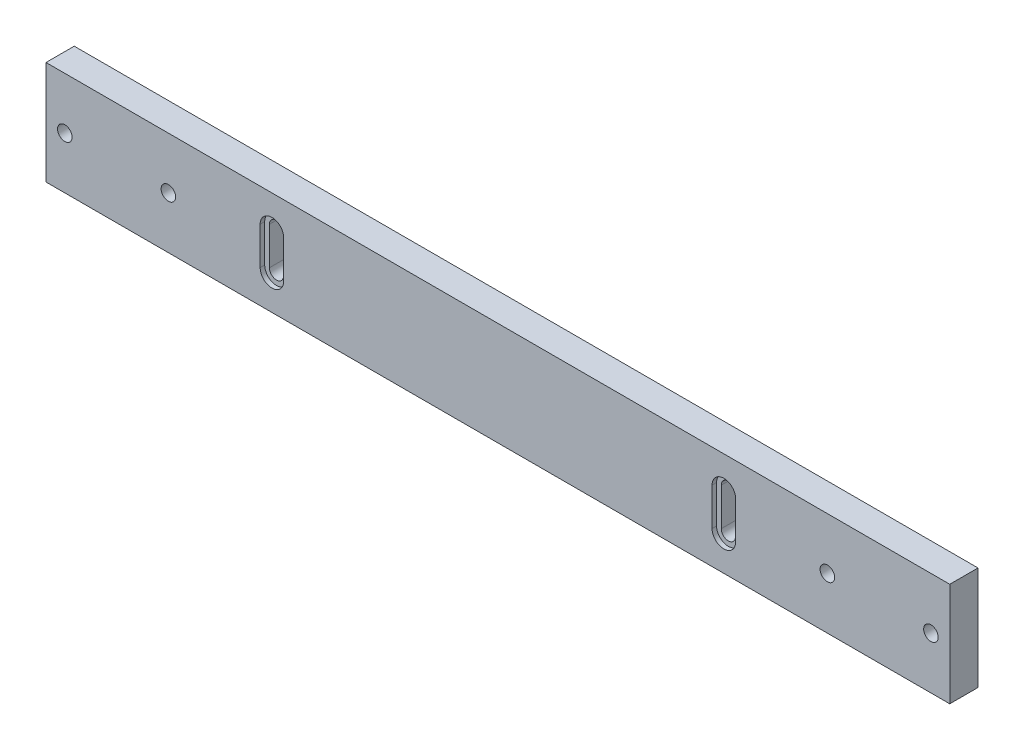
ISO-10303-21;
HEADER;
FILE_DESCRIPTION(('STEP AP214'),'2;1');
FILE_NAME('part.step','',(''),(''),'','','');
FILE_SCHEMA(('AUTOMOTIVE_DESIGN { 1 0 10303 214 1 1 1 1 }'));
ENDSEC;
DATA;
#1=APPLICATION_CONTEXT('core data for automotive mechanical design processes');
#2=APPLICATION_PROTOCOL_DEFINITION('international standard','automotive_design',2000,#1);
#3=PRODUCT_CONTEXT('',#1,'mechanical');
#4=PRODUCT('Part','Part','',(#3));
#5=PRODUCT_RELATED_PRODUCT_CATEGORY('part','',(#4));
#6=PRODUCT_DEFINITION_FORMATION('','',#4);
#7=PRODUCT_DEFINITION_CONTEXT('part definition',#1,'design');
#8=PRODUCT_DEFINITION('design','',#6,#7);
#9=PRODUCT_DEFINITION_SHAPE('','',#8);
#10=(LENGTH_UNIT() NAMED_UNIT(*) SI_UNIT(.MILLI.,.METRE.));
#11=(NAMED_UNIT(*) PLANE_ANGLE_UNIT() SI_UNIT($,.RADIAN.));
#12=(NAMED_UNIT(*) SI_UNIT($,.STERADIAN.) SOLID_ANGLE_UNIT());
#13=UNCERTAINTY_MEASURE_WITH_UNIT(LENGTH_MEASURE(1.E-05),#10,'distance_accuracy_value','');
#14=(GEOMETRIC_REPRESENTATION_CONTEXT(3) GLOBAL_UNCERTAINTY_ASSIGNED_CONTEXT((#13)) GLOBAL_UNIT_ASSIGNED_CONTEXT((#10,
#11,#12)) REPRESENTATION_CONTEXT('',''));
#15=CARTESIAN_POINT('',(0.,0.,0.));
#16=DIRECTION('',(0.,0.,1.));
#17=DIRECTION('',(1.,0.,0.));
#18=AXIS2_PLACEMENT_3D('',#15,#16,#17);
#19=CARTESIAN_POINT('',(0.,0.,19.05));
#20=DIRECTION('',(0.,0.,1.));
#21=DIRECTION('',(1.,0.,0.));
#22=AXIS2_PLACEMENT_3D('',#19,#20,#21);
#23=PLANE('',#22);
#24=CARTESIAN_POINT('',(-152.4,12.7,19.05));
#25=DIRECTION('',(0.,0.,1.));
#26=DIRECTION('',(-1.,0.,0.));
#27=AXIS2_PLACEMENT_3D('',#24,#25,#26);
#28=CIRCLE('',#27,7.9375);
#29=CARTESIAN_POINT('',(-144.4625,12.7,19.05));
#30=VERTEX_POINT('',#29);
#31=CARTESIAN_POINT('',(-160.3375,12.7,19.05));
#32=VERTEX_POINT('',#31);
#33=EDGE_CURVE('E225',#30,#32,#28,.T.);
#34=ORIENTED_EDGE('',*,*,#33,.F.);
#35=DIRECTION('',(0.,1.,0.));
#36=VECTOR('',#35,1.);
#37=CARTESIAN_POINT('',(-144.4625,12.7,19.05));
#38=LINE('',#37,#36);
#39=CARTESIAN_POINT('',(-144.4625,-12.7,19.05));
#40=VERTEX_POINT('',#39);
#41=EDGE_CURVE('E238',#40,#30,#38,.T.);
#42=ORIENTED_EDGE('',*,*,#41,.F.);
#43=CARTESIAN_POINT('',(-152.4,-12.7,19.05));
#44=DIRECTION('',(0.,0.,1.));
#45=DIRECTION('',(-1.,0.,0.));
#46=AXIS2_PLACEMENT_3D('',#43,#44,#45);
#47=CIRCLE('',#46,7.9375);
#48=CARTESIAN_POINT('',(-160.3375,-12.7,19.05));
#49=VERTEX_POINT('',#48);
#50=EDGE_CURVE('E252',#49,#40,#47,.T.);
#51=ORIENTED_EDGE('',*,*,#50,.F.);
#52=DIRECTION('',(0.,-1.,0.));
#53=VECTOR('',#52,1.);
#54=CARTESIAN_POINT('',(-160.3375,12.7,19.05));
#55=LINE('',#54,#53);
#56=EDGE_CURVE('E249',#32,#49,#55,.T.);
#57=ORIENTED_EDGE('',*,*,#56,.F.);
#58=EDGE_LOOP('',(#34,#42,#51,#57));
#59=FACE_BOUND('',#58,.T.);
#60=CARTESIAN_POINT('',(292.1,0.,19.05));
#61=DIRECTION('',(0.,0.,-1.));
#62=DIRECTION('',(-1.,0.,0.));
#63=AXIS2_PLACEMENT_3D('',#60,#61,#62);
#64=CIRCLE('',#63,4.90219999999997);
#65=CARTESIAN_POINT('',(287.1978,0.,19.05));
#66=VERTEX_POINT('',#65);
#67=EDGE_CURVE('E307',#66,#66,#64,.T.);
#68=ORIENTED_EDGE('',*,*,#67,.T.);
#69=EDGE_LOOP('',(#68));
#70=FACE_BOUND('',#69,.T.);
#71=CARTESIAN_POINT('',(222.25,0.,19.05));
#72=DIRECTION('',(0.,0.,-1.));
#73=DIRECTION('',(-1.,0.,0.));
#74=AXIS2_PLACEMENT_3D('',#71,#72,#73);
#75=CIRCLE('',#74,4.9022);
#76=CARTESIAN_POINT('',(217.3478,0.,19.05));
#77=VERTEX_POINT('',#76);
#78=EDGE_CURVE('E319',#77,#77,#75,.T.);
#79=ORIENTED_EDGE('',*,*,#78,.T.);
#80=EDGE_LOOP('',(#79));
#81=FACE_BOUND('',#80,.T.);
#82=CARTESIAN_POINT('',(-222.25,0.,19.05));
#83=DIRECTION('',(0.,0.,-1.));
#84=DIRECTION('',(-1.,0.,0.));
#85=AXIS2_PLACEMENT_3D('',#82,#83,#84);
#86=CIRCLE('',#85,4.9022);
#87=CARTESIAN_POINT('',(-227.1522,0.,19.05));
#88=VERTEX_POINT('',#87);
#89=EDGE_CURVE('E331',#88,#88,#86,.T.);
#90=ORIENTED_EDGE('',*,*,#89,.T.);
#91=EDGE_LOOP('',(#90));
#92=FACE_BOUND('',#91,.T.);
#93=CARTESIAN_POINT('',(-292.1,0.,19.05));
#94=DIRECTION('',(0.,0.,-1.));
#95=DIRECTION('',(-1.,0.,0.));
#96=AXIS2_PLACEMENT_3D('',#93,#94,#95);
#97=CIRCLE('',#96,4.90219999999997);
#98=CARTESIAN_POINT('',(-297.0022,0.,19.05));
#99=VERTEX_POINT('',#98);
#100=EDGE_CURVE('E343',#99,#99,#97,.T.);
#101=ORIENTED_EDGE('',*,*,#100,.T.);
#102=EDGE_LOOP('',(#101));
#103=FACE_BOUND('',#102,.T.);
#104=DIRECTION('',(0.,-1.,0.));
#105=VECTOR('',#104,1.);
#106=CARTESIAN_POINT('',(-304.8,34.925,19.05));
#107=LINE('',#106,#105);
#108=CARTESIAN_POINT('',(-304.8,34.925,19.05));
#109=VERTEX_POINT('',#108);
#110=CARTESIAN_POINT('',(-304.8,-34.9250000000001,19.05));
#111=VERTEX_POINT('',#110);
#112=EDGE_CURVE('E347',#109,#111,#107,.T.);
#113=ORIENTED_EDGE('',*,*,#112,.T.);
#114=DIRECTION('',(1.,0.,0.));
#115=VECTOR('',#114,1.);
#116=CARTESIAN_POINT('',(-304.8,-34.9250000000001,19.05));
#117=LINE('',#116,#115);
#118=CARTESIAN_POINT('',(304.8,-34.925,19.05));
#119=VERTEX_POINT('',#118);
#120=EDGE_CURVE('E350',#111,#119,#117,.T.);
#121=ORIENTED_EDGE('',*,*,#120,.T.);
#122=DIRECTION('',(0.,1.,0.));
#123=VECTOR('',#122,1.);
#124=CARTESIAN_POINT('',(304.8,34.9250000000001,19.05));
#125=LINE('',#124,#123);
#126=CARTESIAN_POINT('',(304.8,34.9250000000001,19.05));
#127=VERTEX_POINT('',#126);
#128=EDGE_CURVE('E353',#119,#127,#125,.T.);
#129=ORIENTED_EDGE('',*,*,#128,.T.);
#130=DIRECTION('',(-1.,0.,0.));
#131=VECTOR('',#130,1.);
#132=CARTESIAN_POINT('',(-304.8,34.925,19.05));
#133=LINE('',#132,#131);
#134=EDGE_CURVE('E355',#127,#109,#133,.T.);
#135=ORIENTED_EDGE('',*,*,#134,.T.);
#136=EDGE_LOOP('',(#113,#121,#129,#135));
#137=FACE_BOUND('',#136,.T.);
#138=DIRECTION('',(0.,1.,0.));
#139=VECTOR('',#138,1.);
#140=CARTESIAN_POINT('',(144.4625,12.7,19.05));
#141=LINE('',#140,#139);
#142=CARTESIAN_POINT('',(144.4625,-12.7,19.05));
#143=VERTEX_POINT('',#142);
#144=CARTESIAN_POINT('',(144.4625,12.7,19.05));
#145=VERTEX_POINT('',#144);
#146=EDGE_CURVE('E198',#143,#145,#141,.T.);
#147=ORIENTED_EDGE('',*,*,#146,.T.);
#148=CARTESIAN_POINT('',(152.4,12.7,19.05));
#149=DIRECTION('',(0.,0.,-1.));
#150=DIRECTION('',(1.,0.,0.));
#151=AXIS2_PLACEMENT_3D('',#148,#149,#150);
#152=CIRCLE('',#151,7.9375);
#153=CARTESIAN_POINT('',(160.3375,12.7,19.05));
#154=VERTEX_POINT('',#153);
#155=EDGE_CURVE('E48',#145,#154,#152,.T.);
#156=ORIENTED_EDGE('',*,*,#155,.T.);
#157=DIRECTION('',(0.,-1.,0.));
#158=VECTOR('',#157,1.);
#159=CARTESIAN_POINT('',(160.3375,12.7,19.05));
#160=LINE('',#159,#158);
#161=CARTESIAN_POINT('',(160.3375,-12.7,19.05));
#162=VERTEX_POINT('',#161);
#163=EDGE_CURVE('E189',#154,#162,#160,.T.);
#164=ORIENTED_EDGE('',*,*,#163,.T.);
#165=CARTESIAN_POINT('',(152.4,-12.7,19.05));
#166=DIRECTION('',(0.,0.,-1.));
#167=DIRECTION('',(1.,0.,0.));
#168=AXIS2_PLACEMENT_3D('',#165,#166,#167);
#169=CIRCLE('',#168,7.9375);
#170=EDGE_CURVE('E192',#162,#143,#169,.T.);
#171=ORIENTED_EDGE('',*,*,#170,.T.);
#172=EDGE_LOOP('',(#147,#156,#164,#171));
#173=FACE_BOUND('',#172,.T.);
#174=ADVANCED_FACE('F33',(#59,#70,#81,#92,#103,#137,#173),#23,.T.);
#175=CARTESIAN_POINT('',(0.,0.,0.));
#176=DIRECTION('',(0.,0.,1.));
#177=DIRECTION('',(1.,0.,0.));
#178=AXIS2_PLACEMENT_3D('',#175,#176,#177);
#179=PLANE('',#178);
#180=DIRECTION('',(0.,-1.,0.));
#181=VECTOR('',#180,1.);
#182=CARTESIAN_POINT('',(-304.8,34.925,0.));
#183=LINE('',#182,#181);
#184=CARTESIAN_POINT('',(-304.8,34.925,0.));
#185=VERTEX_POINT('',#184);
#186=CARTESIAN_POINT('',(-304.8,-34.9250000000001,0.));
#187=VERTEX_POINT('',#186);
#188=EDGE_CURVE('E346',#185,#187,#183,.T.);
#189=ORIENTED_EDGE('',*,*,#188,.F.);
#190=DIRECTION('',(-1.,0.,0.));
#191=VECTOR('',#190,1.);
#192=CARTESIAN_POINT('',(-304.8,34.925,0.));
#193=LINE('',#192,#191);
#194=CARTESIAN_POINT('',(304.8,34.9250000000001,0.));
#195=VERTEX_POINT('',#194);
#196=EDGE_CURVE('E351',#195,#185,#193,.T.);
#197=ORIENTED_EDGE('',*,*,#196,.F.);
#198=DIRECTION('',(0.,1.,0.));
#199=VECTOR('',#198,1.);
#200=CARTESIAN_POINT('',(304.8,34.9250000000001,0.));
#201=LINE('',#200,#199);
#202=CARTESIAN_POINT('',(304.8,-34.925,0.));
#203=VERTEX_POINT('',#202);
#204=EDGE_CURVE('E362',#203,#195,#201,.T.);
#205=ORIENTED_EDGE('',*,*,#204,.F.);
#206=DIRECTION('',(1.,0.,0.));
#207=VECTOR('',#206,1.);
#208=CARTESIAN_POINT('',(-304.8,-34.9250000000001,0.));
#209=LINE('',#208,#207);
#210=EDGE_CURVE('E360',#187,#203,#209,.T.);
#211=ORIENTED_EDGE('',*,*,#210,.F.);
#212=EDGE_LOOP('',(#189,#197,#205,#211));
#213=FACE_BOUND('',#212,.T.);
#214=CARTESIAN_POINT('',(-292.1,0.,0.));
#215=DIRECTION('',(0.,0.,-1.));
#216=DIRECTION('',(-1.,0.,0.));
#217=AXIS2_PLACEMENT_3D('',#214,#215,#216);
#218=CIRCLE('',#217,7.93749999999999);
#219=CARTESIAN_POINT('',(-300.0375,0.,0.));
#220=VERTEX_POINT('',#219);
#221=EDGE_CURVE('E334',#220,#220,#218,.T.);
#222=ORIENTED_EDGE('',*,*,#221,.F.);
#223=EDGE_LOOP('',(#222));
#224=FACE_BOUND('',#223,.T.);
#225=CARTESIAN_POINT('',(-222.25,0.,0.));
#226=DIRECTION('',(0.,0.,-1.));
#227=DIRECTION('',(-1.,0.,0.));
#228=AXIS2_PLACEMENT_3D('',#225,#226,#227);
#229=CIRCLE('',#228,7.93750000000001);
#230=CARTESIAN_POINT('',(-230.1875,0.,0.));
#231=VERTEX_POINT('',#230);
#232=EDGE_CURVE('E322',#231,#231,#229,.T.);
#233=ORIENTED_EDGE('',*,*,#232,.F.);
#234=EDGE_LOOP('',(#233));
#235=FACE_BOUND('',#234,.T.);
#236=CARTESIAN_POINT('',(222.25,0.,0.));
#237=DIRECTION('',(0.,0.,-1.));
#238=DIRECTION('',(-1.,0.,0.));
#239=AXIS2_PLACEMENT_3D('',#236,#237,#238);
#240=CIRCLE('',#239,7.93750000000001);
#241=CARTESIAN_POINT('',(214.3125,0.,0.));
#242=VERTEX_POINT('',#241);
#243=EDGE_CURVE('E310',#242,#242,#240,.T.);
#244=ORIENTED_EDGE('',*,*,#243,.F.);
#245=EDGE_LOOP('',(#244));
#246=FACE_BOUND('',#245,.T.);
#247=CARTESIAN_POINT('',(292.1,0.,0.));
#248=DIRECTION('',(0.,0.,-1.));
#249=DIRECTION('',(-1.,0.,0.));
#250=AXIS2_PLACEMENT_3D('',#247,#248,#249);
#251=CIRCLE('',#250,7.93749999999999);
#252=CARTESIAN_POINT('',(284.1625,0.,0.));
#253=VERTEX_POINT('',#252);
#254=EDGE_CURVE('E290',#253,#253,#251,.T.);
#255=ORIENTED_EDGE('',*,*,#254,.F.);
#256=EDGE_LOOP('',(#255));
#257=FACE_BOUND('',#256,.T.);
#258=DIRECTION('',(0.,1.,0.));
#259=VECTOR('',#258,1.);
#260=CARTESIAN_POINT('',(-147.6375,12.7,0.));
#261=LINE('',#260,#259);
#262=CARTESIAN_POINT('',(-147.6375,-12.7,0.));
#263=VERTEX_POINT('',#262);
#264=CARTESIAN_POINT('',(-147.6375,12.7,0.));
#265=VERTEX_POINT('',#264);
#266=EDGE_CURVE('E283',#263,#265,#261,.T.);
#267=ORIENTED_EDGE('',*,*,#266,.T.);
#268=CARTESIAN_POINT('',(-152.4,12.7,0.));
#269=DIRECTION('',(0.,0.,1.));
#270=DIRECTION('',(-1.,0.,0.));
#271=AXIS2_PLACEMENT_3D('',#268,#269,#270);
#272=CIRCLE('',#271,4.7625);
#273=CARTESIAN_POINT('',(-157.1625,12.7,0.));
#274=VERTEX_POINT('',#273);
#275=EDGE_CURVE('E274',#265,#274,#272,.T.);
#276=ORIENTED_EDGE('',*,*,#275,.T.);
#277=DIRECTION('',(0.,-1.,0.));
#278=VECTOR('',#277,1.);
#279=CARTESIAN_POINT('',(-157.1625,12.7,0.));
#280=LINE('',#279,#278);
#281=CARTESIAN_POINT('',(-157.1625,-12.7,0.));
#282=VERTEX_POINT('',#281);
#283=EDGE_CURVE('E277',#274,#282,#280,.T.);
#284=ORIENTED_EDGE('',*,*,#283,.T.);
#285=CARTESIAN_POINT('',(-152.4,-12.7,0.));
#286=DIRECTION('',(0.,0.,1.));
#287=DIRECTION('',(-1.,0.,0.));
#288=AXIS2_PLACEMENT_3D('',#285,#286,#287);
#289=CIRCLE('',#288,4.7625);
#290=EDGE_CURVE('E280',#282,#263,#289,.T.);
#291=ORIENTED_EDGE('',*,*,#290,.T.);
#292=EDGE_LOOP('',(#267,#276,#284,#291));
#293=FACE_BOUND('',#292,.T.);
#294=CARTESIAN_POINT('',(152.4,12.7,0.));
#295=DIRECTION('',(0.,0.,-1.));
#296=DIRECTION('',(1.,0.,0.));
#297=AXIS2_PLACEMENT_3D('',#294,#295,#296);
#298=CIRCLE('',#297,4.7625);
#299=CARTESIAN_POINT('',(147.6375,12.7,0.));
#300=VERTEX_POINT('',#299);
#301=CARTESIAN_POINT('',(157.1625,12.7,0.));
#302=VERTEX_POINT('',#301);
#303=EDGE_CURVE('E212',#300,#302,#298,.T.);
#304=ORIENTED_EDGE('',*,*,#303,.F.);
#305=DIRECTION('',(0.,1.,0.));
#306=VECTOR('',#305,1.);
#307=CARTESIAN_POINT('',(147.6375,12.7,0.));
#308=LINE('',#307,#306);
#309=CARTESIAN_POINT('',(147.6375,-12.7,0.));
#310=VERTEX_POINT('',#309);
#311=EDGE_CURVE('E214',#310,#300,#308,.T.);
#312=ORIENTED_EDGE('',*,*,#311,.F.);
#313=CARTESIAN_POINT('',(152.4,-12.7,0.));
#314=DIRECTION('',(0.,0.,-1.));
#315=DIRECTION('',(1.,0.,0.));
#316=AXIS2_PLACEMENT_3D('',#313,#314,#315);
#317=CIRCLE('',#316,4.7625);
#318=CARTESIAN_POINT('',(157.1625,-12.7,0.));
#319=VERTEX_POINT('',#318);
#320=EDGE_CURVE('E216',#319,#310,#317,.T.);
#321=ORIENTED_EDGE('',*,*,#320,.F.);
#322=DIRECTION('',(0.,-1.,0.));
#323=VECTOR('',#322,1.);
#324=CARTESIAN_POINT('',(157.1625,12.7,0.));
#325=LINE('',#324,#323);
#326=EDGE_CURVE('E219',#302,#319,#325,.T.);
#327=ORIENTED_EDGE('',*,*,#326,.F.);
#328=EDGE_LOOP('',(#304,#312,#321,#327));
#329=FACE_BOUND('',#328,.T.);
#330=ADVANCED_FACE('F385',(#213,#224,#235,#246,#257,#293,#329),#179,.F.);
#331=CARTESIAN_POINT('',(-304.8,34.925,19.05));
#332=DIRECTION('',(1.,0.,0.));
#333=DIRECTION('',(0.,0.,-1.));
#334=AXIS2_PLACEMENT_3D('',#331,#332,#333);
#335=PLANE('',#334);
#336=ORIENTED_EDGE('',*,*,#188,.T.);
#337=DIRECTION('',(0.,0.,-1.));
#338=VECTOR('',#337,1.);
#339=CARTESIAN_POINT('',(-304.8,-34.9250000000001,19.05));
#340=LINE('',#339,#338);
#341=EDGE_CURVE('E373',#111,#187,#340,.T.);
#342=ORIENTED_EDGE('',*,*,#341,.F.);
#343=ORIENTED_EDGE('',*,*,#112,.F.);
#344=DIRECTION('',(0.,0.,-1.));
#345=VECTOR('',#344,1.);
#346=CARTESIAN_POINT('',(-304.8,34.925,19.05));
#347=LINE('',#346,#345);
#348=EDGE_CURVE('E357',#109,#185,#347,.T.);
#349=ORIENTED_EDGE('',*,*,#348,.T.);
#350=EDGE_LOOP('',(#336,#342,#343,#349));
#351=FACE_BOUND('',#350,.T.);
#352=ADVANCED_FACE('F35',(#351),#335,.F.);
#353=CARTESIAN_POINT('',(-304.8,-34.9250000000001,19.05));
#354=DIRECTION('',(0.,1.,0.));
#355=DIRECTION('',(-1.,0.,0.));
#356=AXIS2_PLACEMENT_3D('',#353,#354,#355);
#357=PLANE('',#356);
#358=ORIENTED_EDGE('',*,*,#210,.T.);
#359=DIRECTION('',(0.,0.,-1.));
#360=VECTOR('',#359,1.);
#361=CARTESIAN_POINT('',(304.8,-34.925,19.05));
#362=LINE('',#361,#360);
#363=EDGE_CURVE('E370',#119,#203,#362,.T.);
#364=ORIENTED_EDGE('',*,*,#363,.F.);
#365=ORIENTED_EDGE('',*,*,#120,.F.);
#366=ORIENTED_EDGE('',*,*,#341,.T.);
#367=EDGE_LOOP('',(#358,#364,#365,#366));
#368=FACE_BOUND('',#367,.T.);
#369=ADVANCED_FACE('F423',(#368),#357,.F.);
#370=CARTESIAN_POINT('',(304.8,34.9250000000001,19.05));
#371=DIRECTION('',(-1.,0.,0.));
#372=DIRECTION('',(0.,0.,1.));
#373=AXIS2_PLACEMENT_3D('',#370,#371,#372);
#374=PLANE('',#373);
#375=ORIENTED_EDGE('',*,*,#204,.T.);
#376=DIRECTION('',(0.,0.,-1.));
#377=VECTOR('',#376,1.);
#378=CARTESIAN_POINT('',(304.8,34.9250000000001,19.05));
#379=LINE('',#378,#377);
#380=EDGE_CURVE('E367',#127,#195,#379,.T.);
#381=ORIENTED_EDGE('',*,*,#380,.F.);
#382=ORIENTED_EDGE('',*,*,#128,.F.);
#383=ORIENTED_EDGE('',*,*,#363,.T.);
#384=EDGE_LOOP('',(#375,#381,#382,#383));
#385=FACE_BOUND('',#384,.T.);
#386=ADVANCED_FACE('F420',(#385),#374,.F.);
#387=CARTESIAN_POINT('',(-304.8,34.925,19.05));
#388=DIRECTION('',(0.,-1.,0.));
#389=DIRECTION('',(1.,0.,0.));
#390=AXIS2_PLACEMENT_3D('',#387,#388,#389);
#391=PLANE('',#390);
#392=ORIENTED_EDGE('',*,*,#196,.T.);
#393=ORIENTED_EDGE('',*,*,#348,.F.);
#394=ORIENTED_EDGE('',*,*,#134,.F.);
#395=ORIENTED_EDGE('',*,*,#380,.T.);
#396=EDGE_LOOP('',(#392,#393,#394,#395));
#397=FACE_BOUND('',#396,.T.);
#398=ADVANCED_FACE('F417',(#397),#391,.F.);
#399=CARTESIAN_POINT('',(-292.1,0.,0.));
#400=DIRECTION('',(0.,0.,-1.));
#401=DIRECTION('',(-1.,0.,0.));
#402=AXIS2_PLACEMENT_3D('',#399,#400,#401);
#403=CYLINDRICAL_SURFACE('',#402,4.9022);
#404=ORIENTED_EDGE('',*,*,#100,.F.);
#405=EDGE_LOOP('',(#404));
#406=FACE_BOUND('',#405,.T.);
#407=CARTESIAN_POINT('',(-292.1,0.,9.525));
#408=DIRECTION('',(0.,0.,-1.));
#409=DIRECTION('',(-1.,0.,0.));
#410=AXIS2_PLACEMENT_3D('',#407,#408,#409);
#411=CIRCLE('',#410,4.90220000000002);
#412=CARTESIAN_POINT('',(-297.0022,0.,9.525));
#413=VERTEX_POINT('',#412);
#414=EDGE_CURVE('E340',#413,#413,#411,.T.);
#415=ORIENTED_EDGE('',*,*,#414,.T.);
#416=EDGE_LOOP('',(#415));
#417=FACE_BOUND('',#416,.T.);
#418=ADVANCED_FACE('F414',(#406,#417),#403,.F.);
#419=CARTESIAN_POINT('',(-287.1978,0.,9.525));
#420=DIRECTION('',(0.,0.,1.));
#421=DIRECTION('',(1.,0.,0.));
#422=AXIS2_PLACEMENT_3D('',#419,#420,#421);
#423=PLANE('',#422);
#424=ORIENTED_EDGE('',*,*,#414,.F.);
#425=EDGE_LOOP('',(#424));
#426=FACE_BOUND('',#425,.T.);
#427=CARTESIAN_POINT('',(-292.1,0.,9.525));
#428=DIRECTION('',(0.,0.,-1.));
#429=DIRECTION('',(-1.,0.,0.));
#430=AXIS2_PLACEMENT_3D('',#427,#428,#429);
#431=CIRCLE('',#430,7.93749999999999);
#432=CARTESIAN_POINT('',(-300.0375,0.,9.525));
#433=VERTEX_POINT('',#432);
#434=EDGE_CURVE('E337',#433,#433,#431,.T.);
#435=ORIENTED_EDGE('',*,*,#434,.T.);
#436=EDGE_LOOP('',(#435));
#437=FACE_BOUND('',#436,.T.);
#438=ADVANCED_FACE('F711',(#426,#437),#423,.F.);
#439=CARTESIAN_POINT('',(-292.1,0.,0.));
#440=DIRECTION('',(0.,0.,-1.));
#441=DIRECTION('',(-1.,0.,0.));
#442=AXIS2_PLACEMENT_3D('',#439,#440,#441);
#443=CYLINDRICAL_SURFACE('',#442,7.93749999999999);
#444=ORIENTED_EDGE('',*,*,#434,.F.);
#445=EDGE_LOOP('',(#444));
#446=FACE_BOUND('',#445,.T.);
#447=ORIENTED_EDGE('',*,*,#221,.T.);
#448=EDGE_LOOP('',(#447));
#449=FACE_BOUND('',#448,.T.);
#450=ADVANCED_FACE('F702',(#446,#449),#443,.F.);
#451=CARTESIAN_POINT('',(-222.25,0.,0.));
#452=DIRECTION('',(0.,0.,-1.));
#453=DIRECTION('',(-1.,0.,0.));
#454=AXIS2_PLACEMENT_3D('',#451,#452,#453);
#455=CYLINDRICAL_SURFACE('',#454,4.9022);
#456=ORIENTED_EDGE('',*,*,#89,.F.);
#457=EDGE_LOOP('',(#456));
#458=FACE_BOUND('',#457,.T.);
#459=CARTESIAN_POINT('',(-222.25,0.,9.525));
#460=DIRECTION('',(0.,0.,-1.));
#461=DIRECTION('',(-1.,0.,0.));
#462=AXIS2_PLACEMENT_3D('',#459,#460,#461);
#463=CIRCLE('',#462,4.9022);
#464=CARTESIAN_POINT('',(-227.1522,0.,9.525));
#465=VERTEX_POINT('',#464);
#466=EDGE_CURVE('E328',#465,#465,#463,.T.);
#467=ORIENTED_EDGE('',*,*,#466,.T.);
#468=EDGE_LOOP('',(#467));
#469=FACE_BOUND('',#468,.T.);
#470=ADVANCED_FACE('F693',(#458,#469),#455,.F.);
#471=CARTESIAN_POINT('',(-217.3478,0.,9.525));
#472=DIRECTION('',(0.,0.,1.));
#473=DIRECTION('',(1.,0.,0.));
#474=AXIS2_PLACEMENT_3D('',#471,#472,#473);
#475=PLANE('',#474);
#476=ORIENTED_EDGE('',*,*,#466,.F.);
#477=EDGE_LOOP('',(#476));
#478=FACE_BOUND('',#477,.T.);
#479=CARTESIAN_POINT('',(-222.25,0.,9.525));
#480=DIRECTION('',(0.,0.,-1.));
#481=DIRECTION('',(-1.,0.,0.));
#482=AXIS2_PLACEMENT_3D('',#479,#480,#481);
#483=CIRCLE('',#482,7.93750000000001);
#484=CARTESIAN_POINT('',(-230.1875,0.,9.525));
#485=VERTEX_POINT('',#484);
#486=EDGE_CURVE('E325',#485,#485,#483,.T.);
#487=ORIENTED_EDGE('',*,*,#486,.T.);
#488=EDGE_LOOP('',(#487));
#489=FACE_BOUND('',#488,.T.);
#490=ADVANCED_FACE('F684',(#478,#489),#475,.F.);
#491=CARTESIAN_POINT('',(-222.25,0.,0.));
#492=DIRECTION('',(0.,0.,-1.));
#493=DIRECTION('',(-1.,0.,0.));
#494=AXIS2_PLACEMENT_3D('',#491,#492,#493);
#495=CYLINDRICAL_SURFACE('',#494,7.93750000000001);
#496=ORIENTED_EDGE('',*,*,#486,.F.);
#497=EDGE_LOOP('',(#496));
#498=FACE_BOUND('',#497,.T.);
#499=ORIENTED_EDGE('',*,*,#232,.T.);
#500=EDGE_LOOP('',(#499));
#501=FACE_BOUND('',#500,.T.);
#502=ADVANCED_FACE('F675',(#498,#501),#495,.F.);
#503=CARTESIAN_POINT('',(222.25,0.,0.));
#504=DIRECTION('',(0.,0.,-1.));
#505=DIRECTION('',(-1.,0.,0.));
#506=AXIS2_PLACEMENT_3D('',#503,#504,#505);
#507=CYLINDRICAL_SURFACE('',#506,4.9022);
#508=ORIENTED_EDGE('',*,*,#78,.F.);
#509=EDGE_LOOP('',(#508));
#510=FACE_BOUND('',#509,.T.);
#511=CARTESIAN_POINT('',(222.25,0.,9.525));
#512=DIRECTION('',(0.,0.,-1.));
#513=DIRECTION('',(-1.,0.,0.));
#514=AXIS2_PLACEMENT_3D('',#511,#512,#513);
#515=CIRCLE('',#514,4.9022);
#516=CARTESIAN_POINT('',(217.3478,0.,9.525));
#517=VERTEX_POINT('',#516);
#518=EDGE_CURVE('E316',#517,#517,#515,.T.);
#519=ORIENTED_EDGE('',*,*,#518,.T.);
#520=EDGE_LOOP('',(#519));
#521=FACE_BOUND('',#520,.T.);
#522=ADVANCED_FACE('F666',(#510,#521),#507,.F.);
#523=CARTESIAN_POINT('',(227.1522,0.,9.525));
#524=DIRECTION('',(0.,0.,1.));
#525=DIRECTION('',(1.,0.,0.));
#526=AXIS2_PLACEMENT_3D('',#523,#524,#525);
#527=PLANE('',#526);
#528=ORIENTED_EDGE('',*,*,#518,.F.);
#529=EDGE_LOOP('',(#528));
#530=FACE_BOUND('',#529,.T.);
#531=CARTESIAN_POINT('',(222.25,0.,9.525));
#532=DIRECTION('',(0.,0.,-1.));
#533=DIRECTION('',(-1.,0.,0.));
#534=AXIS2_PLACEMENT_3D('',#531,#532,#533);
#535=CIRCLE('',#534,7.93750000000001);
#536=CARTESIAN_POINT('',(214.3125,0.,9.525));
#537=VERTEX_POINT('',#536);
#538=EDGE_CURVE('E313',#537,#537,#535,.T.);
#539=ORIENTED_EDGE('',*,*,#538,.T.);
#540=EDGE_LOOP('',(#539));
#541=FACE_BOUND('',#540,.T.);
#542=ADVANCED_FACE('F657',(#530,#541),#527,.F.);
#543=CARTESIAN_POINT('',(222.25,0.,0.));
#544=DIRECTION('',(0.,0.,-1.));
#545=DIRECTION('',(-1.,0.,0.));
#546=AXIS2_PLACEMENT_3D('',#543,#544,#545);
#547=CYLINDRICAL_SURFACE('',#546,7.93750000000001);
#548=ORIENTED_EDGE('',*,*,#538,.F.);
#549=EDGE_LOOP('',(#548));
#550=FACE_BOUND('',#549,.T.);
#551=ORIENTED_EDGE('',*,*,#243,.T.);
#552=EDGE_LOOP('',(#551));
#553=FACE_BOUND('',#552,.T.);
#554=ADVANCED_FACE('F648',(#550,#553),#547,.F.);
#555=CARTESIAN_POINT('',(292.1,0.,0.));
#556=DIRECTION('',(0.,0.,-1.));
#557=DIRECTION('',(-1.,0.,0.));
#558=AXIS2_PLACEMENT_3D('',#555,#556,#557);
#559=CYLINDRICAL_SURFACE('',#558,4.9022);
#560=ORIENTED_EDGE('',*,*,#67,.F.);
#561=EDGE_LOOP('',(#560));
#562=FACE_BOUND('',#561,.T.);
#563=CARTESIAN_POINT('',(292.1,0.,9.525));
#564=DIRECTION('',(0.,0.,-1.));
#565=DIRECTION('',(-1.,0.,0.));
#566=AXIS2_PLACEMENT_3D('',#563,#564,#565);
#567=CIRCLE('',#566,4.90220000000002);
#568=CARTESIAN_POINT('',(287.1978,0.,9.525));
#569=VERTEX_POINT('',#568);
#570=EDGE_CURVE('E304',#569,#569,#567,.T.);
#571=ORIENTED_EDGE('',*,*,#570,.T.);
#572=EDGE_LOOP('',(#571));
#573=FACE_BOUND('',#572,.T.);
#574=ADVANCED_FACE('F639',(#562,#573),#559,.F.);
#575=CARTESIAN_POINT('',(297.0022,0.,9.525));
#576=DIRECTION('',(0.,0.,1.));
#577=DIRECTION('',(1.,0.,0.));
#578=AXIS2_PLACEMENT_3D('',#575,#576,#577);
#579=PLANE('',#578);
#580=ORIENTED_EDGE('',*,*,#570,.F.);
#581=EDGE_LOOP('',(#580));
#582=FACE_BOUND('',#581,.T.);
#583=CARTESIAN_POINT('',(292.1,0.,9.525));
#584=DIRECTION('',(0.,0.,-1.));
#585=DIRECTION('',(-1.,0.,0.));
#586=AXIS2_PLACEMENT_3D('',#583,#584,#585);
#587=CIRCLE('',#586,7.93749999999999);
#588=CARTESIAN_POINT('',(284.1625,0.,9.525));
#589=VERTEX_POINT('',#588);
#590=EDGE_CURVE('E301',#589,#589,#587,.T.);
#591=ORIENTED_EDGE('',*,*,#590,.T.);
#592=EDGE_LOOP('',(#591));
#593=FACE_BOUND('',#592,.T.);
#594=ADVANCED_FACE('F630',(#582,#593),#579,.F.);
#595=CARTESIAN_POINT('',(292.1,0.,0.));
#596=DIRECTION('',(0.,0.,-1.));
#597=DIRECTION('',(-1.,0.,0.));
#598=AXIS2_PLACEMENT_3D('',#595,#596,#597);
#599=CYLINDRICAL_SURFACE('',#598,7.93749999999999);
#600=ORIENTED_EDGE('',*,*,#590,.F.);
#601=EDGE_LOOP('',(#600));
#602=FACE_BOUND('',#601,.T.);
#603=ORIENTED_EDGE('',*,*,#254,.T.);
#604=EDGE_LOOP('',(#603));
#605=FACE_BOUND('',#604,.T.);
#606=ADVANCED_FACE('F400',(#602,#605),#599,.F.);
#607=CARTESIAN_POINT('',(-152.4,12.7,0.));
#608=DIRECTION('',(0.,0.,1.));
#609=DIRECTION('',(1.,0.,0.));
#610=AXIS2_PLACEMENT_3D('',#607,#608,#609);
#611=CYLINDRICAL_SURFACE('',#610,4.7625);
#612=DIRECTION('',(0.,0.,1.));
#613=VECTOR('',#612,1.);
#614=CARTESIAN_POINT('',(-147.6375,12.7,0.));
#615=LINE('',#614,#613);
#616=CARTESIAN_POINT('',(-147.6375,12.7,16.002));
#617=VERTEX_POINT('',#616);
#618=EDGE_CURVE('E287',#265,#617,#615,.T.);
#619=ORIENTED_EDGE('',*,*,#618,.T.);
#620=CARTESIAN_POINT('',(-152.4,12.7,16.002));
#621=DIRECTION('',(0.,0.,-1.));
#622=DIRECTION('',(-1.,0.,0.));
#623=AXIS2_PLACEMENT_3D('',#620,#621,#622);
#624=CIRCLE('',#623,4.7625);
#625=CARTESIAN_POINT('',(-157.1625,12.7,16.002));
#626=VERTEX_POINT('',#625);
#627=EDGE_CURVE('E271',#617,#626,#624,.F.);
#628=ORIENTED_EDGE('',*,*,#627,.T.);
#629=DIRECTION('',(0.,0.,1.));
#630=VECTOR('',#629,1.);
#631=CARTESIAN_POINT('',(-157.1625,12.7,0.));
#632=LINE('',#631,#630);
#633=EDGE_CURVE('E286',#274,#626,#632,.T.);
#634=ORIENTED_EDGE('',*,*,#633,.F.);
#635=ORIENTED_EDGE('',*,*,#275,.F.);
#636=EDGE_LOOP('',(#619,#628,#634,#635));
#637=FACE_BOUND('',#636,.T.);
#638=ADVANCED_FACE('F389',(#637),#611,.F.);
#639=CARTESIAN_POINT('',(-147.6375,12.7,0.));
#640=DIRECTION('',(1.,0.,0.));
#641=DIRECTION('',(0.,0.,-1.));
#642=AXIS2_PLACEMENT_3D('',#639,#640,#641);
#643=PLANE('',#642);
#644=DIRECTION('',(0.,0.,1.));
#645=VECTOR('',#644,1.);
#646=CARTESIAN_POINT('',(-147.6375,-12.7,0.));
#647=LINE('',#646,#645);
#648=CARTESIAN_POINT('',(-147.6375,-12.7,16.002));
#649=VERTEX_POINT('',#648);
#650=EDGE_CURVE('E291',#263,#649,#647,.T.);
#651=ORIENTED_EDGE('',*,*,#650,.T.);
#652=DIRECTION('',(0.,1.,0.));
#653=VECTOR('',#652,1.);
#654=CARTESIAN_POINT('',(-147.6375,12.7,16.002));
#655=LINE('',#654,#653);
#656=EDGE_CURVE('E268',#649,#617,#655,.T.);
#657=ORIENTED_EDGE('',*,*,#656,.T.);
#658=ORIENTED_EDGE('',*,*,#618,.F.);
#659=ORIENTED_EDGE('',*,*,#266,.F.);
#660=EDGE_LOOP('',(#651,#657,#658,#659));
#661=FACE_BOUND('',#660,.T.);
#662=ADVANCED_FACE('F392',(#661),#643,.F.);
#663=CARTESIAN_POINT('',(-152.4,-12.7,0.));
#664=DIRECTION('',(0.,0.,1.));
#665=DIRECTION('',(1.,0.,0.));
#666=AXIS2_PLACEMENT_3D('',#663,#664,#665);
#667=CYLINDRICAL_SURFACE('',#666,4.7625);
#668=DIRECTION('',(0.,0.,1.));
#669=VECTOR('',#668,1.);
#670=CARTESIAN_POINT('',(-157.1625,-12.7,0.));
#671=LINE('',#670,#669);
#672=CARTESIAN_POINT('',(-157.1625,-12.7,16.002));
#673=VERTEX_POINT('',#672);
#674=EDGE_CURVE('E294',#282,#673,#671,.T.);
#675=ORIENTED_EDGE('',*,*,#674,.T.);
#676=CARTESIAN_POINT('',(-152.4,-12.7,16.002));
#677=DIRECTION('',(0.,0.,-1.));
#678=DIRECTION('',(-1.,0.,0.));
#679=AXIS2_PLACEMENT_3D('',#676,#677,#678);
#680=CIRCLE('',#679,4.7625);
#681=EDGE_CURVE('E259',#673,#649,#680,.F.);
#682=ORIENTED_EDGE('',*,*,#681,.T.);
#683=ORIENTED_EDGE('',*,*,#650,.F.);
#684=ORIENTED_EDGE('',*,*,#290,.F.);
#685=EDGE_LOOP('',(#675,#682,#683,#684));
#686=FACE_BOUND('',#685,.T.);
#687=ADVANCED_FACE('F382',(#686),#667,.F.);
#688=CARTESIAN_POINT('',(-157.1625,12.7,0.));
#689=DIRECTION('',(-1.,0.,0.));
#690=DIRECTION('',(0.,0.,1.));
#691=AXIS2_PLACEMENT_3D('',#688,#689,#690);
#692=PLANE('',#691);
#693=ORIENTED_EDGE('',*,*,#633,.T.);
#694=DIRECTION('',(0.,-1.,0.));
#695=VECTOR('',#694,1.);
#696=CARTESIAN_POINT('',(-157.1625,12.7,16.002));
#697=LINE('',#696,#695);
#698=EDGE_CURVE('E41',#626,#673,#697,.T.);
#699=ORIENTED_EDGE('',*,*,#698,.T.);
#700=ORIENTED_EDGE('',*,*,#674,.F.);
#701=ORIENTED_EDGE('',*,*,#283,.F.);
#702=EDGE_LOOP('',(#693,#699,#700,#701));
#703=FACE_BOUND('',#702,.T.);
#704=ADVANCED_FACE('F378',(#703),#692,.F.);
#705=CARTESIAN_POINT('',(-152.4,12.7,16.002));
#706=DIRECTION('',(0.,0.,-1.));
#707=DIRECTION('',(-1.,0.,0.));
#708=AXIS2_PLACEMENT_3D('',#705,#706,#707);
#709=PLANE('',#708);
#710=CARTESIAN_POINT('',(-152.4,12.7,16.002));
#711=DIRECTION('',(0.,0.,1.));
#712=DIRECTION('',(-1.,0.,0.));
#713=AXIS2_PLACEMENT_3D('',#710,#711,#712);
#714=CIRCLE('',#713,7.9375);
#715=CARTESIAN_POINT('',(-144.4625,12.7,16.002));
#716=VERTEX_POINT('',#715);
#717=CARTESIAN_POINT('',(-160.3375,12.7,16.002));
#718=VERTEX_POINT('',#717);
#719=EDGE_CURVE('E234',#716,#718,#714,.T.);
#720=ORIENTED_EDGE('',*,*,#719,.T.);
#721=DIRECTION('',(0.,-1.,0.));
#722=VECTOR('',#721,1.);
#723=CARTESIAN_POINT('',(-160.3375,12.7,16.002));
#724=LINE('',#723,#722);
#725=CARTESIAN_POINT('',(-160.3375,-12.7,16.002));
#726=VERTEX_POINT('',#725);
#727=EDGE_CURVE('E237',#718,#726,#724,.T.);
#728=ORIENTED_EDGE('',*,*,#727,.T.);
#729=CARTESIAN_POINT('',(-152.4,-12.7,16.002));
#730=DIRECTION('',(0.,0.,1.));
#731=DIRECTION('',(-1.,0.,0.));
#732=AXIS2_PLACEMENT_3D('',#729,#730,#731);
#733=CIRCLE('',#732,7.9375);
#734=CARTESIAN_POINT('',(-144.4625,-12.7,16.002));
#735=VERTEX_POINT('',#734);
#736=EDGE_CURVE('E241',#726,#735,#733,.T.);
#737=ORIENTED_EDGE('',*,*,#736,.T.);
#738=DIRECTION('',(0.,1.,0.));
#739=VECTOR('',#738,1.);
#740=CARTESIAN_POINT('',(-144.4625,12.7,16.002));
#741=LINE('',#740,#739);
#742=EDGE_CURVE('E244',#735,#716,#741,.T.);
#743=ORIENTED_EDGE('',*,*,#742,.T.);
#744=EDGE_LOOP('',(#720,#728,#737,#743));
#745=FACE_BOUND('',#744,.T.);
#746=ORIENTED_EDGE('',*,*,#656,.F.);
#747=ORIENTED_EDGE('',*,*,#681,.F.);
#748=ORIENTED_EDGE('',*,*,#698,.F.);
#749=ORIENTED_EDGE('',*,*,#627,.F.);
#750=EDGE_LOOP('',(#746,#747,#748,#749));
#751=FACE_BOUND('',#750,.T.);
#752=ADVANCED_FACE('F390',(#745,#751),#709,.F.);
#753=CARTESIAN_POINT('',(-152.4,12.7,16.002));
#754=DIRECTION('',(0.,0.,1.));
#755=DIRECTION('',(1.,0.,0.));
#756=AXIS2_PLACEMENT_3D('',#753,#754,#755);
#757=CYLINDRICAL_SURFACE('',#756,7.9375);
#758=ORIENTED_EDGE('',*,*,#33,.T.);
#759=DIRECTION('',(0.,0.,1.));
#760=VECTOR('',#759,1.);
#761=CARTESIAN_POINT('',(-160.3375,12.7,16.002));
#762=LINE('',#761,#760);
#763=EDGE_CURVE('E247',#718,#32,#762,.T.);
#764=ORIENTED_EDGE('',*,*,#763,.F.);
#765=ORIENTED_EDGE('',*,*,#719,.F.);
#766=DIRECTION('',(0.,0.,1.));
#767=VECTOR('',#766,1.);
#768=CARTESIAN_POINT('',(-144.4625,12.7,16.002));
#769=LINE('',#768,#767);
#770=EDGE_CURVE('E257',#716,#30,#769,.T.);
#771=ORIENTED_EDGE('',*,*,#770,.T.);
#772=EDGE_LOOP('',(#758,#764,#765,#771));
#773=FACE_BOUND('',#772,.T.);
#774=ADVANCED_FACE('F481',(#773),#757,.F.);
#775=CARTESIAN_POINT('',(-144.4625,12.7,16.002));
#776=DIRECTION('',(1.,0.,0.));
#777=DIRECTION('',(0.,0.,-1.));
#778=AXIS2_PLACEMENT_3D('',#775,#776,#777);
#779=PLANE('',#778);
#780=ORIENTED_EDGE('',*,*,#41,.T.);
#781=ORIENTED_EDGE('',*,*,#770,.F.);
#782=ORIENTED_EDGE('',*,*,#742,.F.);
#783=DIRECTION('',(0.,0.,1.));
#784=VECTOR('',#783,1.);
#785=CARTESIAN_POINT('',(-144.4625,-12.7,16.002));
#786=LINE('',#785,#784);
#787=EDGE_CURVE('E260',#735,#40,#786,.T.);
#788=ORIENTED_EDGE('',*,*,#787,.T.);
#789=EDGE_LOOP('',(#780,#781,#782,#788));
#790=FACE_BOUND('',#789,.T.);
#791=ADVANCED_FACE('F483',(#790),#779,.F.);
#792=CARTESIAN_POINT('',(-152.4,-12.7,16.002));
#793=DIRECTION('',(0.,0.,1.));
#794=DIRECTION('',(1.,0.,0.));
#795=AXIS2_PLACEMENT_3D('',#792,#793,#794);
#796=CYLINDRICAL_SURFACE('',#795,7.9375);
#797=ORIENTED_EDGE('',*,*,#50,.T.);
#798=ORIENTED_EDGE('',*,*,#787,.F.);
#799=ORIENTED_EDGE('',*,*,#736,.F.);
#800=DIRECTION('',(0.,0.,1.));
#801=VECTOR('',#800,1.);
#802=CARTESIAN_POINT('',(-160.3375,-12.7,16.002));
#803=LINE('',#802,#801);
#804=EDGE_CURVE('E262',#726,#49,#803,.T.);
#805=ORIENTED_EDGE('',*,*,#804,.T.);
#806=EDGE_LOOP('',(#797,#798,#799,#805));
#807=FACE_BOUND('',#806,.T.);
#808=ADVANCED_FACE('F486',(#807),#796,.F.);
#809=CARTESIAN_POINT('',(-160.3375,12.7,16.002));
#810=DIRECTION('',(-1.,0.,0.));
#811=DIRECTION('',(0.,0.,1.));
#812=AXIS2_PLACEMENT_3D('',#809,#810,#811);
#813=PLANE('',#812);
#814=ORIENTED_EDGE('',*,*,#56,.T.);
#815=ORIENTED_EDGE('',*,*,#804,.F.);
#816=ORIENTED_EDGE('',*,*,#727,.F.);
#817=ORIENTED_EDGE('',*,*,#763,.T.);
#818=EDGE_LOOP('',(#814,#815,#816,#817));
#819=FACE_BOUND('',#818,.T.);
#820=ADVANCED_FACE('F477',(#819),#813,.F.);
#821=CARTESIAN_POINT('',(152.4,12.7,0.));
#822=DIRECTION('',(0.,0.,1.));
#823=DIRECTION('',(1.,0.,0.));
#824=AXIS2_PLACEMENT_3D('',#821,#822,#823);
#825=CYLINDRICAL_SURFACE('',#824,4.7625);
#826=CARTESIAN_POINT('',(152.4,12.7,16.002));
#827=DIRECTION('',(0.,0.,-1.));
#828=DIRECTION('',(-1.,0.,0.));
#829=AXIS2_PLACEMENT_3D('',#826,#827,#828);
#830=CIRCLE('',#829,4.7625);
#831=CARTESIAN_POINT('',(147.6375,12.7,16.002));
#832=VERTEX_POINT('',#831);
#833=CARTESIAN_POINT('',(157.1625,12.7,16.002));
#834=VERTEX_POINT('',#833);
#835=EDGE_CURVE('E210',#832,#834,#830,.T.);
#836=ORIENTED_EDGE('',*,*,#835,.F.);
#837=DIRECTION('',(0.,0.,1.));
#838=VECTOR('',#837,1.);
#839=CARTESIAN_POINT('',(147.6375,12.7,0.));
#840=LINE('',#839,#838);
#841=EDGE_CURVE('E221',#300,#832,#840,.T.);
#842=ORIENTED_EDGE('',*,*,#841,.F.);
#843=ORIENTED_EDGE('',*,*,#303,.T.);
#844=DIRECTION('',(0.,0.,1.));
#845=VECTOR('',#844,1.);
#846=CARTESIAN_POINT('',(157.1625,12.7,0.));
#847=LINE('',#846,#845);
#848=EDGE_CURVE('E222',#302,#834,#847,.T.);
#849=ORIENTED_EDGE('',*,*,#848,.T.);
#850=EDGE_LOOP('',(#836,#842,#843,#849));
#851=FACE_BOUND('',#850,.T.);
#852=ADVANCED_FACE('F467',(#851),#825,.F.);
#853=CARTESIAN_POINT('',(157.1625,12.7,0.));
#854=DIRECTION('',(-1.,0.,0.));
#855=DIRECTION('',(0.,0.,1.));
#856=AXIS2_PLACEMENT_3D('',#853,#854,#855);
#857=PLANE('',#856);
#858=DIRECTION('',(0.,-1.,0.));
#859=VECTOR('',#858,1.);
#860=CARTESIAN_POINT('',(157.1625,12.7,16.002));
#861=LINE('',#860,#859);
#862=CARTESIAN_POINT('',(157.1625,-12.7,16.002));
#863=VERTEX_POINT('',#862);
#864=EDGE_CURVE('E208',#834,#863,#861,.T.);
#865=ORIENTED_EDGE('',*,*,#864,.F.);
#866=ORIENTED_EDGE('',*,*,#848,.F.);
#867=ORIENTED_EDGE('',*,*,#326,.T.);
#868=DIRECTION('',(0.,0.,1.));
#869=VECTOR('',#868,1.);
#870=CARTESIAN_POINT('',(157.1625,-12.7,0.));
#871=LINE('',#870,#869);
#872=EDGE_CURVE('E226',#319,#863,#871,.T.);
#873=ORIENTED_EDGE('',*,*,#872,.T.);
#874=EDGE_LOOP('',(#865,#866,#867,#873));
#875=FACE_BOUND('',#874,.T.);
#876=ADVANCED_FACE('F463',(#875),#857,.T.);
#877=CARTESIAN_POINT('',(152.4,-12.7,0.));
#878=DIRECTION('',(0.,0.,1.));
#879=DIRECTION('',(1.,0.,0.));
#880=AXIS2_PLACEMENT_3D('',#877,#878,#879);
#881=CYLINDRICAL_SURFACE('',#880,4.7625);
#882=CARTESIAN_POINT('',(152.4,-12.7,16.002));
#883=DIRECTION('',(0.,0.,-1.));
#884=DIRECTION('',(-1.,0.,0.));
#885=AXIS2_PLACEMENT_3D('',#882,#883,#884);
#886=CIRCLE('',#885,4.7625);
#887=CARTESIAN_POINT('',(147.6375,-12.7,16.002));
#888=VERTEX_POINT('',#887);
#889=EDGE_CURVE('E55',#863,#888,#886,.T.);
#890=ORIENTED_EDGE('',*,*,#889,.F.);
#891=ORIENTED_EDGE('',*,*,#872,.F.);
#892=ORIENTED_EDGE('',*,*,#320,.T.);
#893=DIRECTION('',(0.,0.,1.));
#894=VECTOR('',#893,1.);
#895=CARTESIAN_POINT('',(147.6375,-12.7,0.));
#896=LINE('',#895,#894);
#897=EDGE_CURVE('E229',#310,#888,#896,.T.);
#898=ORIENTED_EDGE('',*,*,#897,.T.);
#899=EDGE_LOOP('',(#890,#891,#892,#898));
#900=FACE_BOUND('',#899,.T.);
#901=ADVANCED_FACE('F466',(#900),#881,.F.);
#902=CARTESIAN_POINT('',(147.6375,12.7,0.));
#903=DIRECTION('',(1.,0.,0.));
#904=DIRECTION('',(0.,0.,-1.));
#905=AXIS2_PLACEMENT_3D('',#902,#903,#904);
#906=PLANE('',#905);
#907=DIRECTION('',(0.,1.,0.));
#908=VECTOR('',#907,1.);
#909=CARTESIAN_POINT('',(147.6375,12.7,16.002));
#910=LINE('',#909,#908);
#911=EDGE_CURVE('E11',#888,#832,#910,.T.);
#912=ORIENTED_EDGE('',*,*,#911,.F.);
#913=ORIENTED_EDGE('',*,*,#897,.F.);
#914=ORIENTED_EDGE('',*,*,#311,.T.);
#915=ORIENTED_EDGE('',*,*,#841,.T.);
#916=EDGE_LOOP('',(#912,#913,#914,#915));
#917=FACE_BOUND('',#916,.T.);
#918=ADVANCED_FACE('F457',(#917),#906,.T.);
#919=CARTESIAN_POINT('',(152.4,12.7,16.002));
#920=DIRECTION('',(0.,0.,1.));
#921=DIRECTION('',(1.,0.,0.));
#922=AXIS2_PLACEMENT_3D('',#919,#920,#921);
#923=CYLINDRICAL_SURFACE('',#922,7.9375);
#924=ORIENTED_EDGE('',*,*,#155,.F.);
#925=DIRECTION('',(0.,0.,1.));
#926=VECTOR('',#925,1.);
#927=CARTESIAN_POINT('',(144.4625,12.7,16.002));
#928=LINE('',#927,#926);
#929=CARTESIAN_POINT('',(144.4625,12.7,16.002));
#930=VERTEX_POINT('',#929);
#931=EDGE_CURVE('E174',#930,#145,#928,.T.);
#932=ORIENTED_EDGE('',*,*,#931,.F.);
#933=CARTESIAN_POINT('',(152.4,12.7,16.002));
#934=DIRECTION('',(0.,0.,-1.));
#935=DIRECTION('',(1.,0.,0.));
#936=AXIS2_PLACEMENT_3D('',#933,#934,#935);
#937=CIRCLE('',#936,7.9375);
#938=CARTESIAN_POINT('',(160.3375,12.7,16.002));
#939=VERTEX_POINT('',#938);
#940=EDGE_CURVE('E181',#930,#939,#937,.T.);
#941=ORIENTED_EDGE('',*,*,#940,.T.);
#942=DIRECTION('',(0.,0.,1.));
#943=VECTOR('',#942,1.);
#944=CARTESIAN_POINT('',(160.3375,12.7,16.002));
#945=LINE('',#944,#943);
#946=EDGE_CURVE('E202',#939,#154,#945,.T.);
#947=ORIENTED_EDGE('',*,*,#946,.T.);
#948=EDGE_LOOP('',(#924,#932,#941,#947));
#949=FACE_BOUND('',#948,.T.);
#950=ADVANCED_FACE('F184',(#949),#923,.F.);
#951=CARTESIAN_POINT('',(160.3375,12.7,16.002));
#952=DIRECTION('',(-1.,0.,0.));
#953=DIRECTION('',(0.,0.,1.));
#954=AXIS2_PLACEMENT_3D('',#951,#952,#953);
#955=PLANE('',#954);
#956=ORIENTED_EDGE('',*,*,#163,.F.);
#957=ORIENTED_EDGE('',*,*,#946,.F.);
#958=DIRECTION('',(0.,-1.,0.));
#959=VECTOR('',#958,1.);
#960=CARTESIAN_POINT('',(160.3375,12.7,16.002));
#961=LINE('',#960,#959);
#962=CARTESIAN_POINT('',(160.3375,-12.7,16.002));
#963=VERTEX_POINT('',#962);
#964=EDGE_CURVE('E186',#939,#963,#961,.T.);
#965=ORIENTED_EDGE('',*,*,#964,.T.);
#966=DIRECTION('',(0.,0.,1.));
#967=VECTOR('',#966,1.);
#968=CARTESIAN_POINT('',(160.3375,-12.7,16.002));
#969=LINE('',#968,#967);
#970=EDGE_CURVE('E204',#963,#162,#969,.T.);
#971=ORIENTED_EDGE('',*,*,#970,.T.);
#972=EDGE_LOOP('',(#956,#957,#965,#971));
#973=FACE_BOUND('',#972,.T.);
#974=ADVANCED_FACE('F449',(#973),#955,.T.);
#975=CARTESIAN_POINT('',(152.4,-12.7,16.002));
#976=DIRECTION('',(0.,0.,1.));
#977=DIRECTION('',(1.,0.,0.));
#978=AXIS2_PLACEMENT_3D('',#975,#976,#977);
#979=CYLINDRICAL_SURFACE('',#978,7.9375);
#980=ORIENTED_EDGE('',*,*,#170,.F.);
#981=ORIENTED_EDGE('',*,*,#970,.F.);
#982=CARTESIAN_POINT('',(152.4,-12.7,16.002));
#983=DIRECTION('',(0.,0.,-1.));
#984=DIRECTION('',(1.,0.,0.));
#985=AXIS2_PLACEMENT_3D('',#982,#983,#984);
#986=CIRCLE('',#985,7.9375);
#987=CARTESIAN_POINT('',(144.4625,-12.7,16.002));
#988=VERTEX_POINT('',#987);
#989=EDGE_CURVE('E180',#963,#988,#986,.T.);
#990=ORIENTED_EDGE('',*,*,#989,.T.);
#991=DIRECTION('',(0.,0.,1.));
#992=VECTOR('',#991,1.);
#993=CARTESIAN_POINT('',(144.4625,-12.7,16.002));
#994=LINE('',#993,#992);
#995=EDGE_CURVE('E176',#988,#143,#994,.T.);
#996=ORIENTED_EDGE('',*,*,#995,.T.);
#997=EDGE_LOOP('',(#980,#981,#990,#996));
#998=FACE_BOUND('',#997,.T.);
#999=ADVANCED_FACE('F447',(#998),#979,.F.);
#1000=CARTESIAN_POINT('',(144.4625,12.7,16.002));
#1001=DIRECTION('',(1.,0.,0.));
#1002=DIRECTION('',(0.,0.,-1.));
#1003=AXIS2_PLACEMENT_3D('',#1000,#1001,#1002);
#1004=PLANE('',#1003);
#1005=ORIENTED_EDGE('',*,*,#146,.F.);
#1006=ORIENTED_EDGE('',*,*,#995,.F.);
#1007=DIRECTION('',(0.,1.,0.));
#1008=VECTOR('',#1007,1.);
#1009=CARTESIAN_POINT('',(144.4625,12.7,16.002));
#1010=LINE('',#1009,#1008);
#1011=EDGE_CURVE('E171',#988,#930,#1010,.T.);
#1012=ORIENTED_EDGE('',*,*,#1011,.T.);
#1013=ORIENTED_EDGE('',*,*,#931,.T.);
#1014=EDGE_LOOP('',(#1005,#1006,#1012,#1013));
#1015=FACE_BOUND('',#1014,.T.);
#1016=ADVANCED_FACE('F173',(#1015),#1004,.T.);
#1017=CARTESIAN_POINT('',(152.4,12.7,16.002));
#1018=DIRECTION('',(0.,0.,-1.));
#1019=DIRECTION('',(1.,0.,0.));
#1020=AXIS2_PLACEMENT_3D('',#1017,#1018,#1019);
#1021=PLANE('',#1020);
#1022=ORIENTED_EDGE('',*,*,#835,.T.);
#1023=ORIENTED_EDGE('',*,*,#864,.T.);
#1024=ORIENTED_EDGE('',*,*,#889,.T.);
#1025=ORIENTED_EDGE('',*,*,#911,.T.);
#1026=EDGE_LOOP('',(#1022,#1023,#1024,#1025));
#1027=FACE_BOUND('',#1026,.T.);
#1028=ORIENTED_EDGE('',*,*,#940,.F.);
#1029=ORIENTED_EDGE('',*,*,#1011,.F.);
#1030=ORIENTED_EDGE('',*,*,#989,.F.);
#1031=ORIENTED_EDGE('',*,*,#964,.F.);
#1032=EDGE_LOOP('',(#1028,#1029,#1030,#1031));
#1033=FACE_BOUND('',#1032,.T.);
#1034=ADVANCED_FACE('F188',(#1027,#1033),#1021,.F.);
#1035=CLOSED_SHELL('',(#174,#330,#352,#369,#386,#398,#418,#438,#450,#470,#490,#502,#522,#542,
#554,#574,#594,#606,#638,#662,#687,#704,#752,#774,#791,#808,#820,#852,#876,#901,#918,#950,#974,
#999,#1016,#1034));
#1036=MANIFOLD_SOLID_BREP('B2',#1035);
#1037=ADVANCED_BREP_SHAPE_REPRESENTATION('',(#18,#1036),#14);
#1038=SHAPE_DEFINITION_REPRESENTATION(#9,#1037);
ENDSEC;
END-ISO-10303-21;
